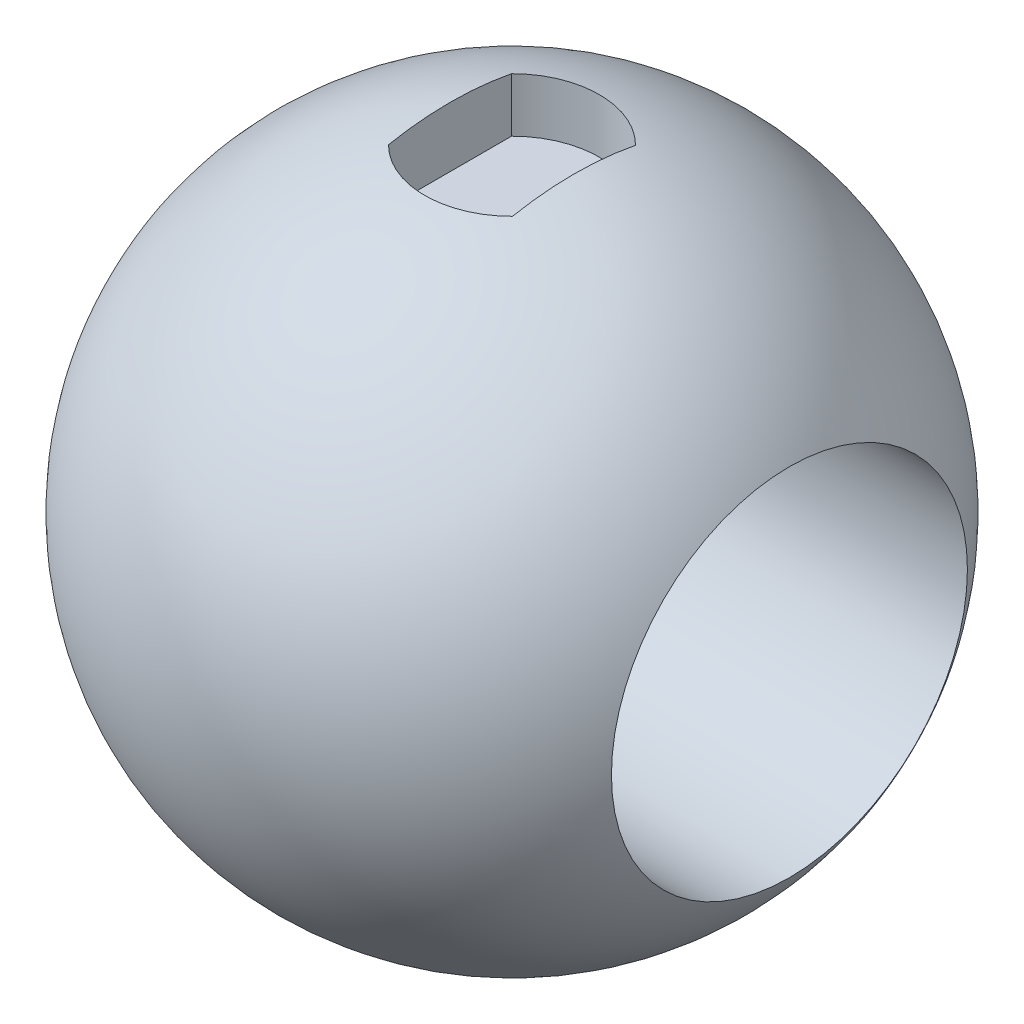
from build123d import *

# Parameters (mm, degrees)
CUT_EXTRUDE1_DEPTH      = 52.961524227
CUT_EXTRUDE1_DEPTH_BACK = 52.961524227
SKETCH3_OUTSIDE_W       = 82.784
SKETCH3_OUTSIDE_H       = 82.784
SKETCH3_OUTSIDE_W_2     = 50.5
SKETCH3_OUTSIDE_H_2     = 67.607532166
SKETCH4_R               = 16.199922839
CUT_EXTRUDE2_DEPTH      = 66.956425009
CUT_EXTRUDE3_DEPTH      = 6


with BuildPart() as part:
    # Sketch1 → Revolve1 (revolve)
    with BuildSketch(Plane.XY):
        with BuildLine():
            Line((-30, 0), (30, 0))
            ThreePointArc((30, 0), (0, 30), (-30, 0))
        make_face()
    revolve(axis=Axis((-30, 0, 0), (1, 0, 0)))

    # Sketch3 outside → Cut-Extrude1 (cut, two sides: drawn at the far end of the back side and taken through both)
    with BuildSketch(Plane.XY.offset(-CUT_EXTRUDE1_DEPTH_BACK)):
        Rectangle(SKETCH3_OUTSIDE_W, SKETCH3_OUTSIDE_H)
        Rectangle(SKETCH3_OUTSIDE_W_2, SKETCH3_OUTSIDE_H_2, mode=Mode.SUBTRACT)
    extrude(amount=CUT_EXTRUDE1_DEPTH + CUT_EXTRUDE1_DEPTH_BACK, mode=Mode.SUBTRACT)

    # Sketch4 → Cut-Extrude2 (cut, through all)
    with BuildSketch(Plane(origin=(25.25, 0, 0), x_dir=(0, 0, -1), z_dir=(1, 0, 0))):
        with Locations(Location((0, 0, 0), (0, 0, 90))):
            Circle(SKETCH4_R)
    extrude(amount=-CUT_EXTRUDE2_DEPTH, mode=Mode.SUBTRACT)

    # Sketch5 → Cut-Extrude3 (cut)
    with BuildSketch(Plane(origin=(0, 30, 0), x_dir=(1, 0, 0), z_dir=(0, 1, 0))):
        with BuildLine():
            Line((-5.642915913, -5.6), (-5.642915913, 5.6))
            ThreePointArc((-5.642915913, 5.6), (0, 7.95), (5.642915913, 5.6))
            Line((5.642915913, 5.6), (5.642915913, -5.6))
            ThreePointArc((5.642915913, -5.6), (0, -7.95), (-5.642915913, -5.6))
        make_face()
    extrude(amount=-CUT_EXTRUDE3_DEPTH, mode=Mode.SUBTRACT)


solid = part.part
